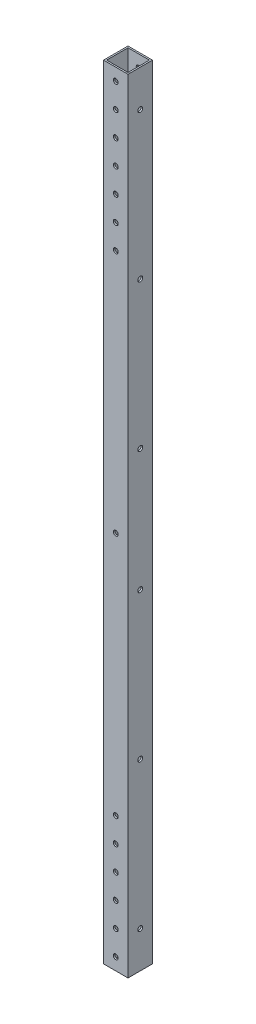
from build123d import *

# Parameters (mm, degrees)
SKETCH1_W                  = 25.4
SKETCH1_H                  = 25.4
SKETCH1_W_2                = 22.225
SKETCH1_H_2                = 22.225
BOSS_EXTRUDE1_DEPTH        = 812.8
F_7_0_201_DIAMETER_HOLE1_D = 5.1054
F_7_0_201_DIAMETER_HOLE2_D = 5.1054


with BuildPart() as part:
    # Sketch1 → Boss-Extrude1 (new body)
    with BuildSketch(Plane(origin=(0, 0, 0), x_dir=(1, 0, 0), z_dir=(0, 1, 0))):
        Rectangle(SKETCH1_W, SKETCH1_H)
        Rectangle(SKETCH1_W_2, SKETCH1_H_2, mode=Mode.SUBTRACT)
    extrude(amount=BOSS_EXTRUDE1_DEPTH)

    # 7 _0.201_ Diameter Hole1 (through all)
    with Locations(Plane.XY.offset(12.7)):
        with Locations((0, 12.7), (0, 38.1), (0, 63.5), (0, 88.9), (0, 114.3), (0, 139.7), (0, 393.7), (0, 647.7), (0, 673.1), (0, 698.5), (0, 723.9), (0, 749.3), (0, 774.7), (0, 800.1)):
            Hole(F_7_0_201_DIAMETER_HOLE1_D / 2)

    # 7 _0.201_ Diameter Hole2 (through all)
    with Locations(Plane(origin=(12.7, 0, 0), x_dir=(0, 0, -1), z_dir=(1, 0, 0))):
        with Locations((0, 38.1), (0, 190.5), (0, 342.9), (0, 469.9), (0, 622.3), (0, 774.7)):
            Hole(F_7_0_201_DIAMETER_HOLE2_D / 2)


solid = part.part
